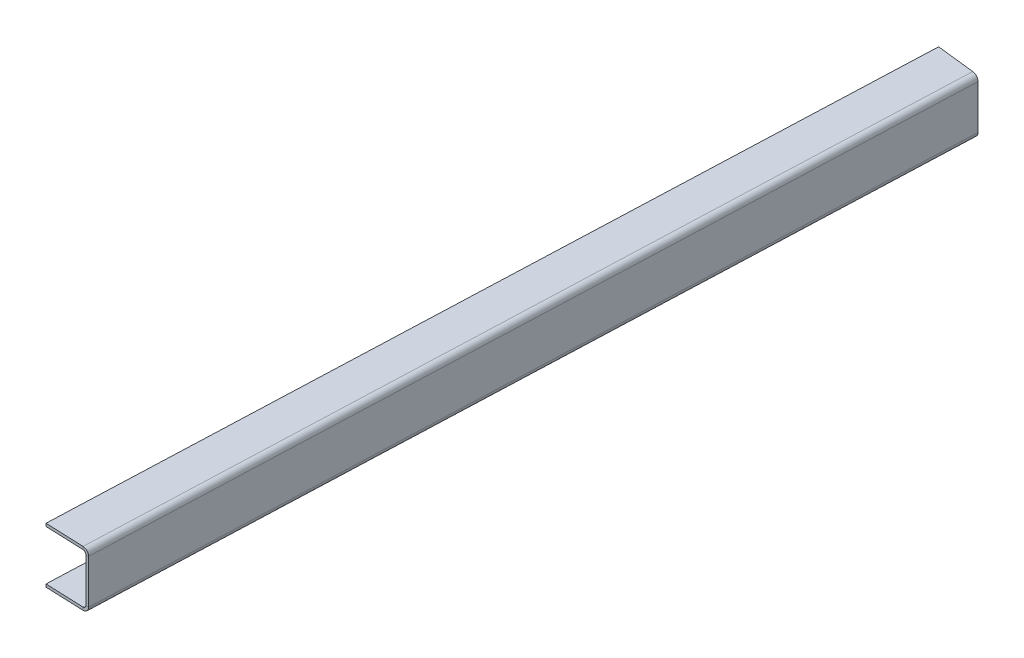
ISO-10303-21;
HEADER;
FILE_DESCRIPTION(('STEP AP214'),'2;1');
FILE_NAME('part.step','',(''),(''),'','','');
FILE_SCHEMA(('AUTOMOTIVE_DESIGN { 1 0 10303 214 1 1 1 1 }'));
ENDSEC;
DATA;
#1=APPLICATION_CONTEXT('core data for automotive mechanical design processes');
#2=APPLICATION_PROTOCOL_DEFINITION('international standard','automotive_design',2000,#1);
#3=PRODUCT_CONTEXT('',#1,'mechanical');
#4=PRODUCT('Part','Part','',(#3));
#5=PRODUCT_RELATED_PRODUCT_CATEGORY('part','',(#4));
#6=PRODUCT_DEFINITION_FORMATION('','',#4);
#7=PRODUCT_DEFINITION_CONTEXT('part definition',#1,'design');
#8=PRODUCT_DEFINITION('design','',#6,#7);
#9=PRODUCT_DEFINITION_SHAPE('','',#8);
#10=(LENGTH_UNIT() NAMED_UNIT(*) SI_UNIT(.MILLI.,.METRE.));
#11=(NAMED_UNIT(*) PLANE_ANGLE_UNIT() SI_UNIT($,.RADIAN.));
#12=(NAMED_UNIT(*) SI_UNIT($,.STERADIAN.) SOLID_ANGLE_UNIT());
#13=UNCERTAINTY_MEASURE_WITH_UNIT(LENGTH_MEASURE(1.E-05),#10,'distance_accuracy_value','');
#14=(GEOMETRIC_REPRESENTATION_CONTEXT(3) GLOBAL_UNCERTAINTY_ASSIGNED_CONTEXT((#13)) GLOBAL_UNIT_ASSIGNED_CONTEXT((#10,
#11,#12)) REPRESENTATION_CONTEXT('',''));
#15=CARTESIAN_POINT('',(0.,0.,0.));
#16=DIRECTION('',(0.,0.,1.));
#17=DIRECTION('',(1.,0.,0.));
#18=AXIS2_PLACEMENT_3D('',#15,#16,#17);
#19=CARTESIAN_POINT('',(-611.843515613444,0.,36.8292453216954));
#20=DIRECTION('',(0.0392134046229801,0.,-0.999230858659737));
#21=DIRECTION('',(0.,1.,0.));
#22=AXIS2_PLACEMENT_3D('',#19,#20,#21);
#23=PLANE('',#22);
#24=DIRECTION('',(-0.999230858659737,0.,-0.0392134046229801));
#25=VECTOR('',#24,1.);
#26=CARTESIAN_POINT('',(-611.843515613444,749.683430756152,36.8292453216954));
#27=LINE('',#26,#25);
#28=CARTESIAN_POINT('',(-610.219165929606,749.683430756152,36.8929906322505));
#29=VERTEX_POINT('',#28);
#30=CARTESIAN_POINT('',(-611.843515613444,749.683430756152,36.8292453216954));
#31=VERTEX_POINT('',#30);
#32=EDGE_CURVE('E12',#29,#31,#27,.T.);
#33=ORIENTED_EDGE('',*,*,#32,.F.);
#34=DIRECTION('',(0.,1.,0.));
#35=VECTOR('',#34,1.);
#36=CARTESIAN_POINT('',(-610.219165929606,0.,36.8929906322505));
#37=LINE('',#36,#35);
#38=CARTESIAN_POINT('',(-610.219165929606,774.931030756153,36.8929906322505));
#39=VERTEX_POINT('',#38);
#40=EDGE_CURVE('E137',#29,#39,#37,.T.);
#41=ORIENTED_EDGE('',*,*,#40,.T.);
#42=DIRECTION('',(-0.999230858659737,0.,-0.0392134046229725));
#43=VECTOR('',#42,1.);
#44=CARTESIAN_POINT('',(-611.843515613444,774.931030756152,36.8292453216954));
#45=LINE('',#44,#43);
#46=CARTESIAN_POINT('',(-611.843515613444,774.931030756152,36.8292453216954));
#47=VERTEX_POINT('',#46);
#48=EDGE_CURVE('E90',#39,#47,#45,.T.);
#49=ORIENTED_EDGE('',*,*,#48,.T.);
#50=DIRECTION('',(0.,1.,0.));
#51=VECTOR('',#50,1.);
#52=CARTESIAN_POINT('',(-611.843515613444,0.,36.8292453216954));
#53=LINE('',#52,#51);
#54=EDGE_CURVE('E139',#31,#47,#53,.T.);
#55=ORIENTED_EDGE('',*,*,#54,.F.);
#56=EDGE_LOOP('',(#33,#41,#49,#55));
#57=FACE_BOUND('',#56,.T.);
#58=ADVANCED_FACE('F78',(#57),#23,.F.);
#59=CARTESIAN_POINT('',(-615.092143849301,774.931030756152,36.6999421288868));
#60=CARTESIAN_POINT('',(-615.633593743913,774.931030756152,36.6786936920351));
#61=CARTESIAN_POINT('',(-616.175043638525,774.931030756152,36.6574452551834));
#62=CARTESIAN_POINT('',(-616.716493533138,774.931030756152,36.6361968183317));
#63=CARTESIAN_POINT('',(-615.092143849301,771.679830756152,36.6999421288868));
#64=CARTESIAN_POINT('',(-615.633593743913,770.596097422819,36.6786936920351));
#65=CARTESIAN_POINT('',(-616.175043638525,769.512364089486,36.6574452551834));
#66=CARTESIAN_POINT('',(-616.716493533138,768.428630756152,36.6361968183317));
#67=CARTESIAN_POINT('',(-611.843515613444,771.679830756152,36.8292453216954));
#68=CARTESIAN_POINT('',(-611.302065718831,770.596097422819,36.8504937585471));
#69=CARTESIAN_POINT('',(-610.760615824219,769.512364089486,36.8717421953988));
#70=CARTESIAN_POINT('',(-610.219165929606,768.428630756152,36.8929906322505));
#71=CARTESIAN_POINT('',(-611.843515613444,774.931030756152,36.8292453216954));
#72=CARTESIAN_POINT('',(-611.302065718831,774.931030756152,36.8504937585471));
#73=CARTESIAN_POINT('',(-610.760615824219,774.931030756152,36.8717421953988));
#74=CARTESIAN_POINT('',(-610.219165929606,774.931030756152,36.8929906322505));
#75=CARTESIAN_POINT('',(-611.843515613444,778.182230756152,36.8292453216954));
#76=CARTESIAN_POINT('',(-611.302065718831,779.265964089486,36.8504937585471));
#77=CARTESIAN_POINT('',(-610.760615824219,780.349697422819,36.8717421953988));
#78=CARTESIAN_POINT('',(-610.219165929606,781.433430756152,36.8929906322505));
#79=CARTESIAN_POINT('',(-615.092143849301,778.182230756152,36.6999421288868));
#80=CARTESIAN_POINT('',(-615.633593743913,779.265964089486,36.6786936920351));
#81=CARTESIAN_POINT('',(-616.175043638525,780.349697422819,36.6574452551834));
#82=CARTESIAN_POINT('',(-616.716493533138,781.433430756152,36.6361968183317));
#83=CARTESIAN_POINT('',(-615.092143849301,774.931030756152,36.6999421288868));
#84=CARTESIAN_POINT('',(-615.633593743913,774.931030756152,36.6786936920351));
#85=CARTESIAN_POINT('',(-616.175043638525,774.931030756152,36.6574452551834));
#86=CARTESIAN_POINT('',(-616.716493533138,774.931030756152,36.6361968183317));
#87=(BOUNDED_SURFACE() B_SPLINE_SURFACE(3,3,((#59,#60,#61,#62),(#63,#64,#65,#66),(#67,#68,#69,
#70),(#71,#72,#73,#74),(#75,#76,#77,#78),(#79,#80,#81,#82),(#83,#84,#85,#86)),.UNSPECIFIED.,.T.,
.F.,.F.) B_SPLINE_SURFACE_WITH_KNOTS((4,3,4),(4,4),(0.,0.5,1.),(0.,1.),
.UNSPECIFIED.) GEOMETRIC_REPRESENTATION_ITEM() RATIONAL_B_SPLINE_SURFACE(((1.,1.,1.,1.),
(0.333333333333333,0.333333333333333,0.333333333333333,0.333333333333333),(0.333333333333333,
0.333333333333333,0.333333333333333,0.333333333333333),(1.,1.,1.,1.),(0.333333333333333,
0.333333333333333,0.333333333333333,0.333333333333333),(0.333333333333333,0.333333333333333,
0.333333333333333,0.333333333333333),(1.,1.,1.,1.))) REPRESENTATION_ITEM('') SURFACE());
#88=CARTESIAN_POINT('',(-613.467829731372,774.931030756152,36.7645937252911));
#89=DIRECTION('',(-0.039492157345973,0.,0.999219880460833));
#90=DIRECTION('',(-0.999219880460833,0.,-0.039492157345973));
#91=AXIS2_PLACEMENT_3D('',#88,#89,#90);
#92=ELLIPSE('',#91,3.25120012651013,3.2512);
#93=CARTESIAN_POINT('',(-613.467829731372,778.182230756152,36.764593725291));
#94=VERTEX_POINT('',#93);
#95=EDGE_CURVE('E215',#39,#94,#92,.T.);
#96=DIRECTION('',(0.,-1.,0.));
#97=VECTOR('',#96,1.);
#98=CARTESIAN_POINT('',(-613.467829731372,776.556630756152,36.764593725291));
#99=LINE('',#98,#97);
#100=CARTESIAN_POINT('',(-613.467829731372,776.556630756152,36.764593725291));
#101=VERTEX_POINT('',#100);
#102=EDGE_CURVE('E205',#94,#101,#99,.T.);
#103=CARTESIAN_POINT('',(-613.467829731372,774.931030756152,36.7645937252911));
#104=DIRECTION('',(-0.0397709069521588,0.,0.999208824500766));
#105=DIRECTION('',(-0.999208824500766,0.,-0.0397709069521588));
#106=AXIS2_PLACEMENT_3D('',#103,#104,#105);
#107=ELLIPSE('',#106,1.62560025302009,1.6256);
#108=EDGE_CURVE('E213',#47,#101,#107,.T.);
#109=ORIENTED_EDGE('',*,*,#48,.F.);
#110=ORIENTED_EDGE('',*,*,#95,.T.);
#111=ORIENTED_EDGE('',*,*,#102,.T.);
#112=ORIENTED_EDGE('',*,*,#108,.F.);
#113=EDGE_LOOP('',(#109,#110,#111,#112));
#114=FACE_BOUND('',#113,.T.);
#115=ADVANCED_FACE('F212',(#114),#87,.F.);
#116=CARTESIAN_POINT('',(-635.603500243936,776.556630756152,35.8835409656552));
#117=DIRECTION('',(-0.0397709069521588,0.,0.999208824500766));
#118=DIRECTION('',(0.999208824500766,0.,0.0397709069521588));
#119=AXIS2_PLACEMENT_3D('',#116,#117,#118);
#120=PLANE('',#119);
#121=ORIENTED_EDGE('',*,*,#102,.F.);
#122=DIRECTION('',(0.999208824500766,0.,0.0397709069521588));
#123=VECTOR('',#122,1.);
#124=CARTESIAN_POINT('',(-635.603500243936,778.182230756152,35.8835409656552));
#125=LINE('',#124,#123);
#126=CARTESIAN_POINT('',(-635.603500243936,778.182230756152,35.8835409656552));
#127=VERTEX_POINT('',#126);
#128=EDGE_CURVE('E176',#127,#94,#125,.T.);
#129=ORIENTED_EDGE('',*,*,#128,.F.);
#130=DIRECTION('',(0.,-1.,0.));
#131=VECTOR('',#130,1.);
#132=CARTESIAN_POINT('',(-635.603500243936,776.556630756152,35.8835409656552));
#133=LINE('',#132,#131);
#134=CARTESIAN_POINT('',(-635.603500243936,776.556630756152,35.8835409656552));
#135=VERTEX_POINT('',#134);
#136=EDGE_CURVE('E202',#127,#135,#133,.T.);
#137=ORIENTED_EDGE('',*,*,#136,.T.);
#138=DIRECTION('',(0.999208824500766,0.,0.0397709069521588));
#139=VECTOR('',#138,1.);
#140=CARTESIAN_POINT('',(-635.603500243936,776.556630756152,35.8835409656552));
#141=LINE('',#140,#139);
#142=EDGE_CURVE('E232',#135,#101,#141,.T.);
#143=ORIENTED_EDGE('',*,*,#142,.T.);
#144=EDGE_LOOP('',(#121,#129,#137,#143));
#145=FACE_BOUND('',#144,.T.);
#146=ADVANCED_FACE('F233',(#145),#120,.T.);
#147=CARTESIAN_POINT('',(-616.284879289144,776.556630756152,-456.391036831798));
#148=DIRECTION('',(-0.999230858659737,0.,-0.0392134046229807));
#149=DIRECTION('',(-0.0392134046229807,0.,0.999230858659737));
#150=AXIS2_PLACEMENT_3D('',#147,#148,#149);
#151=PLANE('',#150);
#152=ORIENTED_EDGE('',*,*,#136,.F.);
#153=DIRECTION('',(-0.0392134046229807,0.,0.999230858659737));
#154=VECTOR('',#153,1.);
#155=CARTESIAN_POINT('',(-616.284879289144,778.182230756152,-456.391036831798));
#156=LINE('',#155,#154);
#157=CARTESIAN_POINT('',(-616.284879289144,778.182230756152,-456.391036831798));
#158=VERTEX_POINT('',#157);
#159=EDGE_CURVE('E168',#158,#127,#156,.T.);
#160=ORIENTED_EDGE('',*,*,#159,.F.);
#161=DIRECTION('',(0.,-1.,0.));
#162=VECTOR('',#161,1.);
#163=CARTESIAN_POINT('',(-616.284879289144,776.556630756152,-456.391036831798));
#164=LINE('',#163,#162);
#165=CARTESIAN_POINT('',(-616.284879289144,776.556630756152,-456.391036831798));
#166=VERTEX_POINT('',#165);
#167=EDGE_CURVE('E199',#158,#166,#164,.T.);
#168=ORIENTED_EDGE('',*,*,#167,.T.);
#169=DIRECTION('',(-0.0392134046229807,0.,0.999230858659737));
#170=VECTOR('',#169,1.);
#171=CARTESIAN_POINT('',(-616.284879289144,776.556630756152,-456.391036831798));
#172=LINE('',#171,#170);
#173=EDGE_CURVE('E237',#166,#135,#172,.T.);
#174=ORIENTED_EDGE('',*,*,#173,.T.);
#175=EDGE_LOOP('',(#152,#160,#168,#174));
#176=FACE_BOUND('',#175,.T.);
#177=ADVANCED_FACE('F280',(#176),#151,.T.);
#178=CARTESIAN_POINT('',(-590.977798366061,776.556630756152,-453.525083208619));
#179=DIRECTION('',(0.112527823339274,0.,-0.993648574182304));
#180=DIRECTION('',(-0.993648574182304,0.,-0.112527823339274));
#181=AXIS2_PLACEMENT_3D('',#178,#179,#180);
#182=PLANE('',#181);
#183=ORIENTED_EDGE('',*,*,#167,.F.);
#184=DIRECTION('',(-0.993648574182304,0.,-0.112527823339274));
#185=VECTOR('',#184,1.);
#186=CARTESIAN_POINT('',(-590.977798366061,778.182230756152,-453.525083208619));
#187=LINE('',#186,#185);
#188=CARTESIAN_POINT('',(-594.21272666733,778.182230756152,-453.891429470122));
#189=VERTEX_POINT('',#188);
#190=EDGE_CURVE('E173',#189,#158,#187,.T.);
#191=ORIENTED_EDGE('',*,*,#190,.F.);
#192=DIRECTION('',(0.,-1.,0.));
#193=VECTOR('',#192,1.);
#194=CARTESIAN_POINT('',(-594.21272666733,776.556630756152,-453.891429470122));
#195=LINE('',#194,#193);
#196=CARTESIAN_POINT('',(-594.21272666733,776.556630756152,-453.891429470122));
#197=VERTEX_POINT('',#196);
#198=EDGE_CURVE('E196',#189,#197,#195,.T.);
#199=ORIENTED_EDGE('',*,*,#198,.T.);
#200=DIRECTION('',(-0.993648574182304,0.,-0.112527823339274));
#201=VECTOR('',#200,1.);
#202=CARTESIAN_POINT('',(-590.977798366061,776.556630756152,-453.525083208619));
#203=LINE('',#202,#201);
#204=EDGE_CURVE('E238',#197,#166,#203,.T.);
#205=ORIENTED_EDGE('',*,*,#204,.T.);
#206=EDGE_LOOP('',(#183,#191,#199,#205));
#207=FACE_BOUND('',#206,.T.);
#208=ADVANCED_FACE('F307',(#207),#182,.T.);
#209=CARTESIAN_POINT('',(-595.832379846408,774.931030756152,-454.074850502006));
#210=CARTESIAN_POINT('',(-596.37382974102,774.931030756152,-454.096098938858));
#211=CARTESIAN_POINT('',(-596.915279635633,774.931030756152,-454.11734737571));
#212=CARTESIAN_POINT('',(-597.456729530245,774.931030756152,-454.138595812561));
#213=CARTESIAN_POINT('',(-595.832379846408,778.182230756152,-454.074850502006));
#214=CARTESIAN_POINT('',(-596.37382974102,779.265964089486,-454.096098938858));
#215=CARTESIAN_POINT('',(-596.915279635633,780.349697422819,-454.11734737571));
#216=CARTESIAN_POINT('',(-597.456729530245,781.433430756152,-454.138595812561));
#217=CARTESIAN_POINT('',(-592.593073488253,778.182230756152,-453.708008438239));
#218=CARTESIAN_POINT('',(-592.051623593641,779.265964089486,-453.686760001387));
#219=CARTESIAN_POINT('',(-591.510173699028,780.349697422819,-453.665511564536));
#220=CARTESIAN_POINT('',(-590.968723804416,781.433430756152,-453.644263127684));
#221=CARTESIAN_POINT('',(-592.593073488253,774.931030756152,-453.708008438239));
#222=CARTESIAN_POINT('',(-592.051623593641,774.931030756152,-453.686760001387));
#223=CARTESIAN_POINT('',(-591.510173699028,774.931030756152,-453.665511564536));
#224=CARTESIAN_POINT('',(-590.968723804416,774.931030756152,-453.644263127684));
#225=CARTESIAN_POINT('',(-592.593073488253,771.679830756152,-453.708008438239));
#226=CARTESIAN_POINT('',(-592.051623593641,770.59609742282,-453.686760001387));
#227=CARTESIAN_POINT('',(-591.510173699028,769.512364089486,-453.665511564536));
#228=CARTESIAN_POINT('',(-590.968723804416,768.428630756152,-453.644263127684));
#229=CARTESIAN_POINT('',(-595.832379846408,771.679830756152,-454.074850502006));
#230=CARTESIAN_POINT('',(-596.37382974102,770.59609742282,-454.096098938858));
#231=CARTESIAN_POINT('',(-596.915279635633,769.512364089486,-454.11734737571));
#232=CARTESIAN_POINT('',(-597.456729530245,768.428630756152,-454.138595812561));
#233=CARTESIAN_POINT('',(-595.832379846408,774.931030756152,-454.074850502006));
#234=CARTESIAN_POINT('',(-596.37382974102,774.931030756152,-454.096098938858));
#235=CARTESIAN_POINT('',(-596.915279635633,774.931030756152,-454.11734737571));
#236=CARTESIAN_POINT('',(-597.456729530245,774.931030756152,-454.138595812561));
#237=(BOUNDED_SURFACE() B_SPLINE_SURFACE(3,3,((#209,#210,#211,#212),(#213,#214,#215,#216),(#217,
#218,#219,#220),(#221,#222,#223,#224),(#225,#226,#227,#228),(#229,#230,#231,#232),(#233,#234,
#235,#236)),.UNSPECIFIED.,.T.,.F.,.F.) B_SPLINE_SURFACE_WITH_KNOTS((4,3,4),(4,4),(0.,0.5,1.),
(0.,1.),.UNSPECIFIED.) GEOMETRIC_REPRESENTATION_ITEM() RATIONAL_B_SPLINE_SURFACE(((1.,1.,1.,1.),
(0.333333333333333,0.333333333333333,0.333333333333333,0.333333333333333),(0.333333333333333,
0.333333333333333,0.333333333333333,0.333333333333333),(1.,1.,1.,1.),(0.333333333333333,
0.333333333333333,0.333333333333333,0.333333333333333),(0.333333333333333,0.333333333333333,
0.333333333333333,0.333333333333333),(1.,1.,1.,1.))) REPRESENTATION_ITEM('') SURFACE());
#238=CARTESIAN_POINT('',(-594.21272666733,774.931030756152,-453.891429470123));
#239=DIRECTION('',(0.075971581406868,0.,-0.997109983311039));
#240=DIRECTION('',(-0.997109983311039,0.,-0.0759715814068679));
#241=AXIS2_PLACEMENT_3D('',#238,#239,#240);
#242=ELLIPSE('',#241,3.25340525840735,3.2512);
#243=CARTESIAN_POINT('',(-590.968723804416,774.931030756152,-453.644263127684));
#244=VERTEX_POINT('',#243);
#245=EDGE_CURVE('E178',#189,#244,#242,.T.);
#246=DIRECTION('',(-0.999230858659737,0.,-0.0392134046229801));
#247=VECTOR('',#246,1.);
#248=CARTESIAN_POINT('',(-592.593073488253,774.931030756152,-453.708008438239));
#249=LINE('',#248,#247);
#250=CARTESIAN_POINT('',(-592.593073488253,774.931030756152,-453.708008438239));
#251=VERTEX_POINT('',#250);
#252=EDGE_CURVE('E194',#244,#251,#249,.T.);
#253=CARTESIAN_POINT('',(-594.21272666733,774.931030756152,-453.891429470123));
#254=DIRECTION('',(0.112527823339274,0.,-0.993648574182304));
#255=DIRECTION('',(-0.993648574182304,0.,-0.112527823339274));
#256=AXIS2_PLACEMENT_3D('',#253,#254,#255);
#257=ELLIPSE('',#256,1.63000604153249,1.6256);
#258=EDGE_CURVE('E229',#197,#251,#257,.T.);
#259=ORIENTED_EDGE('',*,*,#198,.F.);
#260=ORIENTED_EDGE('',*,*,#245,.T.);
#261=ORIENTED_EDGE('',*,*,#252,.T.);
#262=ORIENTED_EDGE('',*,*,#258,.F.);
#263=EDGE_LOOP('',(#259,#260,#261,#262));
#264=FACE_BOUND('',#263,.T.);
#265=ADVANCED_FACE('F357',(#264),#237,.F.);
#266=CARTESIAN_POINT('',(-592.593073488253,0.,-453.708008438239));
#267=DIRECTION('',(-0.0392134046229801,0.,0.999230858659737));
#268=DIRECTION('',(0.,-1.,0.));
#269=AXIS2_PLACEMENT_3D('',#266,#267,#268);
#270=PLANE('',#269);
#271=ORIENTED_EDGE('',*,*,#252,.F.);
#272=DIRECTION('',(0.,1.,0.));
#273=VECTOR('',#272,1.);
#274=CARTESIAN_POINT('',(-590.968723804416,0.,-453.644263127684));
#275=LINE('',#274,#273);
#276=CARTESIAN_POINT('',(-590.968723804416,749.683430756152,-453.644263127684));
#277=VERTEX_POINT('',#276);
#278=EDGE_CURVE('E167',#244,#277,#275,.F.);
#279=ORIENTED_EDGE('',*,*,#278,.T.);
#280=DIRECTION('',(-0.999230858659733,1.45035538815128E-13,-0.039213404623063));
#281=VECTOR('',#280,1.);
#282=CARTESIAN_POINT('',(-592.593073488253,749.683430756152,-453.708008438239));
#283=LINE('',#282,#281);
#284=CARTESIAN_POINT('',(-592.593073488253,749.683430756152,-453.708008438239));
#285=VERTEX_POINT('',#284);
#286=EDGE_CURVE('E191',#277,#285,#283,.T.);
#287=ORIENTED_EDGE('',*,*,#286,.T.);
#288=DIRECTION('',(0.,-1.,0.));
#289=VECTOR('',#288,1.);
#290=CARTESIAN_POINT('',(-592.593073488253,0.,-453.708008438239));
#291=LINE('',#290,#289);
#292=EDGE_CURVE('E284',#251,#285,#291,.T.);
#293=ORIENTED_EDGE('',*,*,#292,.F.);
#294=EDGE_LOOP('',(#271,#279,#287,#293));
#295=FACE_BOUND('',#294,.T.);
#296=ADVANCED_FACE('F322',(#295),#270,.F.);
#297=CARTESIAN_POINT('',(-592.593073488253,749.683430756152,-453.708008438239));
#298=CARTESIAN_POINT('',(-592.051623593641,749.683430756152,-453.686760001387));
#299=CARTESIAN_POINT('',(-591.510173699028,749.683430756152,-453.665511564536));
#300=CARTESIAN_POINT('',(-590.968723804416,749.683430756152,-453.644263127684));
#301=CARTESIAN_POINT('',(-592.593073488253,746.432230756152,-453.708008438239));
#302=CARTESIAN_POINT('',(-592.051623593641,745.348497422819,-453.686760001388));
#303=CARTESIAN_POINT('',(-591.510173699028,744.264764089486,-453.665511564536));
#304=CARTESIAN_POINT('',(-590.968723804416,743.181030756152,-453.644263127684));
#305=CARTESIAN_POINT('',(-595.832379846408,746.432230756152,-454.074850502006));
#306=CARTESIAN_POINT('',(-596.37382974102,745.348497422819,-454.096098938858));
#307=CARTESIAN_POINT('',(-596.915279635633,744.264764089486,-454.11734737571));
#308=CARTESIAN_POINT('',(-597.456729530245,743.181030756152,-454.138595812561));
#309=CARTESIAN_POINT('',(-595.832379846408,749.683430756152,-454.074850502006));
#310=CARTESIAN_POINT('',(-596.37382974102,749.683430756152,-454.096098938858));
#311=CARTESIAN_POINT('',(-596.915279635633,749.683430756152,-454.11734737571));
#312=CARTESIAN_POINT('',(-597.456729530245,749.683430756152,-454.138595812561));
#313=CARTESIAN_POINT('',(-595.832379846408,752.934630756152,-454.074850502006));
#314=CARTESIAN_POINT('',(-596.37382974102,754.018364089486,-454.096098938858));
#315=CARTESIAN_POINT('',(-596.915279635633,755.102097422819,-454.11734737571));
#316=CARTESIAN_POINT('',(-597.456729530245,756.185830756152,-454.138595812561));
#317=CARTESIAN_POINT('',(-592.593073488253,752.934630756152,-453.708008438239));
#318=CARTESIAN_POINT('',(-592.051623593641,754.018364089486,-453.686760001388));
#319=CARTESIAN_POINT('',(-591.510173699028,755.102097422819,-453.665511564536));
#320=CARTESIAN_POINT('',(-590.968723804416,756.185830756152,-453.644263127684));
#321=CARTESIAN_POINT('',(-592.593073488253,749.683430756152,-453.708008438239));
#322=CARTESIAN_POINT('',(-592.051623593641,749.683430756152,-453.686760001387));
#323=CARTESIAN_POINT('',(-591.510173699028,749.683430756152,-453.665511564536));
#324=CARTESIAN_POINT('',(-590.968723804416,749.683430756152,-453.644263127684));
#325=(BOUNDED_SURFACE() B_SPLINE_SURFACE(3,3,((#297,#298,#299,#300),(#301,#302,#303,#304),(#305,
#306,#307,#308),(#309,#310,#311,#312),(#313,#314,#315,#316),(#317,#318,#319,#320),(#321,#322,
#323,#324)),.UNSPECIFIED.,.T.,.F.,.F.) B_SPLINE_SURFACE_WITH_KNOTS((4,3,4),(4,4),(0.,0.5,1.),
(0.,1.),.UNSPECIFIED.) GEOMETRIC_REPRESENTATION_ITEM() RATIONAL_B_SPLINE_SURFACE(((1.,1.,1.,1.),
(0.333333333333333,0.333333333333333,0.333333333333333,0.333333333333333),(0.333333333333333,
0.333333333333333,0.333333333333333,0.333333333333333),(1.,1.,1.,1.),(0.333333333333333,
0.333333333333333,0.333333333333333,0.333333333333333),(0.333333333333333,0.333333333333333,
0.333333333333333,0.333333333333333),(1.,1.,1.,1.))) REPRESENTATION_ITEM('') SURFACE());
#326=CARTESIAN_POINT('',(-594.21272666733,749.683430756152,-453.891429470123));
#327=DIRECTION('',(0.075971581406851,0.,-0.99710998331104));
#328=DIRECTION('',(0.99710998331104,0.,0.075971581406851));
#329=AXIS2_PLACEMENT_3D('',#326,#327,#328);
#330=ELLIPSE('',#329,3.25340525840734,3.2512);
#331=CARTESIAN_POINT('',(-594.21272666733,746.432230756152,-453.891429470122));
#332=VERTEX_POINT('',#331);
#333=EDGE_CURVE('E155',#277,#332,#330,.T.);
#334=DIRECTION('',(0.,1.,0.));
#335=VECTOR('',#334,1.);
#336=CARTESIAN_POINT('',(-594.21272666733,748.057830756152,-453.891429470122));
#337=LINE('',#336,#335);
#338=CARTESIAN_POINT('',(-594.21272666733,748.057830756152,-453.891429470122));
#339=VERTEX_POINT('',#338);
#340=EDGE_CURVE('E188',#332,#339,#337,.T.);
#341=CARTESIAN_POINT('',(-594.21272666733,749.683430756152,-453.891429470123));
#342=DIRECTION('',(0.112527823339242,0.,-0.993648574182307));
#343=DIRECTION('',(0.993648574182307,0.,0.112527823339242));
#344=AXIS2_PLACEMENT_3D('',#341,#342,#343);
#345=ELLIPSE('',#344,1.63000604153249,1.6256);
#346=EDGE_CURVE('E254',#285,#339,#345,.T.);
#347=ORIENTED_EDGE('',*,*,#286,.F.);
#348=ORIENTED_EDGE('',*,*,#333,.T.);
#349=ORIENTED_EDGE('',*,*,#340,.T.);
#350=ORIENTED_EDGE('',*,*,#346,.F.);
#351=EDGE_LOOP('',(#347,#348,#349,#350));
#352=FACE_BOUND('',#351,.T.);
#353=ADVANCED_FACE('F326',(#352),#325,.F.);
#354=CARTESIAN_POINT('',(-616.284879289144,748.057830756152,-456.391036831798));
#355=DIRECTION('',(0.112527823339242,0.,-0.993648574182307));
#356=DIRECTION('',(0.993648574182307,0.,0.112527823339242));
#357=AXIS2_PLACEMENT_3D('',#354,#355,#356);
#358=PLANE('',#357);
#359=ORIENTED_EDGE('',*,*,#340,.F.);
#360=DIRECTION('',(0.993648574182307,0.,0.112527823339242));
#361=VECTOR('',#360,1.);
#362=CARTESIAN_POINT('',(-616.284879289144,746.432230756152,-456.391036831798));
#363=LINE('',#362,#361);
#364=CARTESIAN_POINT('',(-616.284879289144,746.432230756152,-456.391036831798));
#365=VERTEX_POINT('',#364);
#366=EDGE_CURVE('E262',#365,#332,#363,.T.);
#367=ORIENTED_EDGE('',*,*,#366,.F.);
#368=DIRECTION('',(0.,1.,0.));
#369=VECTOR('',#368,1.);
#370=CARTESIAN_POINT('',(-616.284879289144,748.057830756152,-456.391036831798));
#371=LINE('',#370,#369);
#372=CARTESIAN_POINT('',(-616.284879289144,748.057830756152,-456.391036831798));
#373=VERTEX_POINT('',#372);
#374=EDGE_CURVE('E185',#365,#373,#371,.T.);
#375=ORIENTED_EDGE('',*,*,#374,.T.);
#376=DIRECTION('',(0.993648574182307,0.,0.112527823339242));
#377=VECTOR('',#376,1.);
#378=CARTESIAN_POINT('',(-616.284879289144,748.057830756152,-456.391036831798));
#379=LINE('',#378,#377);
#380=EDGE_CURVE('E293',#373,#339,#379,.T.);
#381=ORIENTED_EDGE('',*,*,#380,.T.);
#382=EDGE_LOOP('',(#359,#367,#375,#381));
#383=FACE_BOUND('',#382,.T.);
#384=ADVANCED_FACE('F374',(#383),#358,.T.);
#385=CARTESIAN_POINT('',(-635.603500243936,748.057830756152,35.8835409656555));
#386=DIRECTION('',(-0.999230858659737,0.,-0.0392134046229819));
#387=DIRECTION('',(0.0392134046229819,0.,-0.999230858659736));
#388=AXIS2_PLACEMENT_3D('',#385,#386,#387);
#389=PLANE('',#388);
#390=ORIENTED_EDGE('',*,*,#374,.F.);
#391=DIRECTION('',(0.0392134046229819,0.,-0.999230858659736));
#392=VECTOR('',#391,1.);
#393=CARTESIAN_POINT('',(-635.603500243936,746.432230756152,35.8835409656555));
#394=LINE('',#393,#392);
#395=CARTESIAN_POINT('',(-635.603500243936,746.432230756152,35.8835409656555));
#396=VERTEX_POINT('',#395);
#397=EDGE_CURVE('E255',#396,#365,#394,.T.);
#398=ORIENTED_EDGE('',*,*,#397,.F.);
#399=DIRECTION('',(0.,1.,0.));
#400=VECTOR('',#399,1.);
#401=CARTESIAN_POINT('',(-635.603500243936,748.057830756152,35.8835409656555));
#402=LINE('',#401,#400);
#403=CARTESIAN_POINT('',(-635.603500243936,748.057830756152,35.8835409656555));
#404=VERTEX_POINT('',#403);
#405=EDGE_CURVE('E182',#396,#404,#402,.T.);
#406=ORIENTED_EDGE('',*,*,#405,.T.);
#407=DIRECTION('',(0.0392134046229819,0.,-0.999230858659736));
#408=VECTOR('',#407,1.);
#409=CARTESIAN_POINT('',(-635.603500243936,748.057830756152,35.8835409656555));
#410=LINE('',#409,#408);
#411=EDGE_CURVE('E296',#404,#373,#410,.T.);
#412=ORIENTED_EDGE('',*,*,#411,.T.);
#413=EDGE_LOOP('',(#390,#398,#406,#412));
#414=FACE_BOUND('',#413,.T.);
#415=ADVANCED_FACE('F382',(#414),#389,.T.);
#416=CARTESIAN_POINT('',(-610.223592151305,748.057830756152,36.893722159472));
#417=DIRECTION('',(-0.0397709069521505,0.,0.999208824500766));
#418=DIRECTION('',(-0.999208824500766,0.,-0.0397709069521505));
#419=AXIS2_PLACEMENT_3D('',#416,#417,#418);
#420=PLANE('',#419);
#421=ORIENTED_EDGE('',*,*,#405,.F.);
#422=DIRECTION('',(-0.999208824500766,0.,-0.0397709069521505));
#423=VECTOR('',#422,1.);
#424=CARTESIAN_POINT('',(-610.223592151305,746.432230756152,36.893722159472));
#425=LINE('',#424,#423);
#426=CARTESIAN_POINT('',(-613.467829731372,746.432230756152,36.7645937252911));
#427=VERTEX_POINT('',#426);
#428=EDGE_CURVE('E259',#427,#396,#425,.T.);
#429=ORIENTED_EDGE('',*,*,#428,.F.);
#430=DIRECTION('',(0.,1.,0.));
#431=VECTOR('',#430,1.);
#432=CARTESIAN_POINT('',(-613.467829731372,748.057830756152,36.7645937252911));
#433=LINE('',#432,#431);
#434=CARTESIAN_POINT('',(-613.467829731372,748.057830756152,36.7645937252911));
#435=VERTEX_POINT('',#434);
#436=EDGE_CURVE('E84',#427,#435,#433,.T.);
#437=ORIENTED_EDGE('',*,*,#436,.T.);
#438=DIRECTION('',(-0.999208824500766,0.,-0.0397709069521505));
#439=VECTOR('',#438,1.);
#440=CARTESIAN_POINT('',(-610.223592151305,748.057830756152,36.893722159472));
#441=LINE('',#440,#439);
#442=EDGE_CURVE('E290',#435,#404,#441,.T.);
#443=ORIENTED_EDGE('',*,*,#442,.T.);
#444=EDGE_LOOP('',(#421,#429,#437,#443));
#445=FACE_BOUND('',#444,.T.);
#446=ADVANCED_FACE('F386',(#445),#420,.T.);
#447=CARTESIAN_POINT('',(-611.843515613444,749.683430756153,36.8292453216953));
#448=CARTESIAN_POINT('',(-611.302065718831,749.683430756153,36.850493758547));
#449=CARTESIAN_POINT('',(-610.760615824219,749.683430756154,36.8717421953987));
#450=CARTESIAN_POINT('',(-610.219165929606,749.683430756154,36.8929906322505));
#451=CARTESIAN_POINT('',(-611.843515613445,752.934630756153,36.8292453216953));
#452=CARTESIAN_POINT('',(-611.302065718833,754.018364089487,36.850493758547));
#453=CARTESIAN_POINT('',(-610.760615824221,755.10209742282,36.8717421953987));
#454=CARTESIAN_POINT('',(-610.219165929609,756.185830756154,36.8929906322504));
#455=CARTESIAN_POINT('',(-615.092143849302,752.934630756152,36.6999421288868));
#456=CARTESIAN_POINT('',(-615.633593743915,754.018364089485,36.6786936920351));
#457=CARTESIAN_POINT('',(-616.175043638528,755.102097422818,36.6574452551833));
#458=CARTESIAN_POINT('',(-616.71649353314,756.185830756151,36.6361968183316));
#459=CARTESIAN_POINT('',(-615.092143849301,749.683430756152,36.6999421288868));
#460=CARTESIAN_POINT('',(-615.633593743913,749.683430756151,36.6786936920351));
#461=CARTESIAN_POINT('',(-616.175043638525,749.683430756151,36.6574452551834));
#462=CARTESIAN_POINT('',(-616.716493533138,749.683430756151,36.6361968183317));
#463=CARTESIAN_POINT('',(-615.092143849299,746.432230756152,36.6999421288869));
#464=CARTESIAN_POINT('',(-615.633593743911,745.348497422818,36.6786936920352));
#465=CARTESIAN_POINT('',(-616.175043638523,744.264764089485,36.6574452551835));
#466=CARTESIAN_POINT('',(-616.716493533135,743.181030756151,36.6361968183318));
#467=CARTESIAN_POINT('',(-611.843515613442,746.432230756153,36.8292453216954));
#468=CARTESIAN_POINT('',(-611.30206571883,745.34849742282,36.8504937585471));
#469=CARTESIAN_POINT('',(-610.760615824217,744.264764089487,36.8717421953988));
#470=CARTESIAN_POINT('',(-610.219165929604,743.181030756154,36.8929906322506));
#471=CARTESIAN_POINT('',(-611.843515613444,749.683430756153,36.8292453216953));
#472=CARTESIAN_POINT('',(-611.302065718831,749.683430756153,36.850493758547));
#473=CARTESIAN_POINT('',(-610.760615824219,749.683430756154,36.8717421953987));
#474=CARTESIAN_POINT('',(-610.219165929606,749.683430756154,36.8929906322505));
#475=(BOUNDED_SURFACE() B_SPLINE_SURFACE(3,3,((#447,#448,#449,#450),(#451,#452,#453,#454),(#455,
#456,#457,#458),(#459,#460,#461,#462),(#463,#464,#465,#466),(#467,#468,#469,#470),(#471,#472,
#473,#474)),.UNSPECIFIED.,.T.,.F.,.F.) B_SPLINE_SURFACE_WITH_KNOTS((4,3,4),(4,4),(0.,0.5,1.),
(0.,1.),.UNSPECIFIED.) GEOMETRIC_REPRESENTATION_ITEM() RATIONAL_B_SPLINE_SURFACE(((1.,1.,1.,1.),
(0.333333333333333,0.333333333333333,0.333333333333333,0.333333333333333),(0.333333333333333,
0.333333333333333,0.333333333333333,0.333333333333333),(1.,1.,1.,1.),(0.333333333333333,
0.333333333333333,0.333333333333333,0.333333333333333),(0.333333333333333,0.333333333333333,
0.333333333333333,0.333333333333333),(1.,1.,1.,1.))) REPRESENTATION_ITEM('') SURFACE());
#476=CARTESIAN_POINT('',(-613.467829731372,749.683430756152,36.7645937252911));
#477=DIRECTION('',(-0.0394921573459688,0.,0.999219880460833));
#478=DIRECTION('',(0.999219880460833,4.09777183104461E-13,0.0394921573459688));
#479=AXIS2_PLACEMENT_3D('',#476,#477,#478);
#480=ELLIPSE('',#479,3.25120012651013,3.2512);
#481=EDGE_CURVE('E152',#427,#29,#480,.T.);
#482=CARTESIAN_POINT('',(-613.467829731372,749.683430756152,36.7645937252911));
#483=DIRECTION('',(-0.0397709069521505,0.,0.999208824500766));
#484=DIRECTION('',(0.999208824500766,4.0543697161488E-13,0.0397709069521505));
#485=AXIS2_PLACEMENT_3D('',#482,#483,#484);
#486=ELLIPSE('',#485,1.62560025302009,1.6256);
#487=EDGE_CURVE('E250',#435,#31,#486,.T.);
#488=ORIENTED_EDGE('',*,*,#481,.T.);
#489=ORIENTED_EDGE('',*,*,#32,.T.);
#490=ORIENTED_EDGE('',*,*,#487,.F.);
#491=ORIENTED_EDGE('',*,*,#436,.F.);
#492=EDGE_LOOP('',(#488,#489,#490,#491));
#493=FACE_BOUND('',#492,.T.);
#494=ADVANCED_FACE('F80',(#493),#475,.F.);
#495=CARTESIAN_POINT('',(0.,748.057830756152,-1.72850165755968E-13));
#496=DIRECTION('',(0.,-1.,0.));
#497=DIRECTION('',(0.,0.,-1.));
#498=AXIS2_PLACEMENT_3D('',#495,#496,#497);
#499=PLANE('',#498);
#500=ORIENTED_EDGE('',*,*,#442,.F.);
#501=DIRECTION('',(0.0392134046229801,0.,-0.999230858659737));
#502=VECTOR('',#501,1.);
#503=CARTESIAN_POINT('',(-594.21742317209,748.057830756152,-453.771753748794));
#504=LINE('',#503,#502);
#505=EDGE_CURVE('E247',#435,#339,#504,.T.);
#506=ORIENTED_EDGE('',*,*,#505,.T.);
#507=ORIENTED_EDGE('',*,*,#380,.F.);
#508=ORIENTED_EDGE('',*,*,#411,.F.);
#509=EDGE_LOOP('',(#500,#506,#507,#508));
#510=FACE_BOUND('',#509,.T.);
#511=ADVANCED_FACE('F411',(#510),#499,.F.);
#512=CARTESIAN_POINT('',(-609.457258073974,0.,-23.977057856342));
#513=DIRECTION('',(0.999230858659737,0.,0.0392134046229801));
#514=DIRECTION('',(0.0392134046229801,0.,-0.999230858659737));
#515=AXIS2_PLACEMENT_3D('',#512,#513,#514);
#516=PLANE('',#515);
#517=ORIENTED_EDGE('',*,*,#54,.T.);
#518=DIRECTION('',(-0.0392134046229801,0.,0.999230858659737));
#519=VECTOR('',#518,1.);
#520=CARTESIAN_POINT('',(-592.593073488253,774.931030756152,-453.708008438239));
#521=LINE('',#520,#519);
#522=EDGE_CURVE('E228',#47,#251,#521,.F.);
#523=ORIENTED_EDGE('',*,*,#522,.T.);
#524=ORIENTED_EDGE('',*,*,#292,.T.);
#525=DIRECTION('',(0.0392134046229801,0.,-0.999230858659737));
#526=VECTOR('',#525,1.);
#527=CARTESIAN_POINT('',(-611.843515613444,749.683430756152,36.8292453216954));
#528=LINE('',#527,#526);
#529=EDGE_CURVE('E244',#285,#31,#528,.F.);
#530=ORIENTED_EDGE('',*,*,#529,.T.);
#531=EDGE_LOOP('',(#517,#523,#524,#530));
#532=FACE_BOUND('',#531,.T.);
#533=ADVANCED_FACE('F325',(#532),#516,.F.);
#534=CARTESIAN_POINT('',(0.,776.556630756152,0.));
#535=DIRECTION('',(0.,1.,0.));
#536=DIRECTION('',(0.,0.,1.));
#537=AXIS2_PLACEMENT_3D('',#534,#535,#536);
#538=PLANE('',#537);
#539=ORIENTED_EDGE('',*,*,#204,.F.);
#540=DIRECTION('',(-0.0392134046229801,0.,0.999230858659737));
#541=VECTOR('',#540,1.);
#542=CARTESIAN_POINT('',(-613.467865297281,776.556630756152,36.7655000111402));
#543=LINE('',#542,#541);
#544=EDGE_CURVE('E226',#197,#101,#543,.T.);
#545=ORIENTED_EDGE('',*,*,#544,.T.);
#546=ORIENTED_EDGE('',*,*,#142,.F.);
#547=ORIENTED_EDGE('',*,*,#173,.F.);
#548=EDGE_LOOP('',(#539,#545,#546,#547));
#549=FACE_BOUND('',#548,.T.);
#550=ADVANCED_FACE('F241',(#549),#538,.F.);
#551=CARTESIAN_POINT('',(-611.08394966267,749.683430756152,-23.9811270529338));
#552=DIRECTION('',(-0.0392134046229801,0.,0.999230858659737));
#553=DIRECTION('',(0.999230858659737,0.,0.0392134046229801));
#554=AXIS2_PLACEMENT_3D('',#551,#552,#553);
#555=CYLINDRICAL_SURFACE('',#554,1.6256);
#556=ORIENTED_EDGE('',*,*,#487,.T.);
#557=ORIENTED_EDGE('',*,*,#529,.F.);
#558=ORIENTED_EDGE('',*,*,#346,.T.);
#559=ORIENTED_EDGE('',*,*,#505,.F.);
#560=EDGE_LOOP('',(#556,#557,#558,#559));
#561=FACE_BOUND('',#560,.T.);
#562=ADVANCED_FACE('F327',(#561),#555,.F.);
#563=CARTESIAN_POINT('',(-611.08394966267,774.931030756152,-23.9811270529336));
#564=DIRECTION('',(0.0392134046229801,0.,-0.999230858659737));
#565=DIRECTION('',(-0.999230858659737,0.,-0.0392134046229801));
#566=AXIS2_PLACEMENT_3D('',#563,#564,#565);
#567=CYLINDRICAL_SURFACE('',#566,1.6256);
#568=ORIENTED_EDGE('',*,*,#258,.T.);
#569=ORIENTED_EDGE('',*,*,#522,.F.);
#570=ORIENTED_EDGE('',*,*,#108,.T.);
#571=ORIENTED_EDGE('',*,*,#544,.F.);
#572=EDGE_LOOP('',(#568,#569,#570,#571));
#573=FACE_BOUND('',#572,.T.);
#574=ADVANCED_FACE('F224',(#573),#567,.F.);
#575=CARTESIAN_POINT('',(0.,746.432230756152,-1.72483786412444E-13));
#576=DIRECTION('',(0.,-1.,0.));
#577=DIRECTION('',(0.,0.,-1.));
#578=AXIS2_PLACEMENT_3D('',#575,#576,#577);
#579=PLANE('',#578);
#580=ORIENTED_EDGE('',*,*,#428,.T.);
#581=ORIENTED_EDGE('',*,*,#397,.T.);
#582=ORIENTED_EDGE('',*,*,#366,.T.);
#583=DIRECTION('',(-0.0392134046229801,0.,0.999230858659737));
#584=VECTOR('',#583,1.);
#585=CARTESIAN_POINT('',(-611.08394966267,746.432230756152,-23.9811270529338));
#586=LINE('',#585,#584);
#587=EDGE_CURVE('E160',#427,#332,#586,.F.);
#588=ORIENTED_EDGE('',*,*,#587,.F.);
#589=EDGE_LOOP('',(#580,#581,#582,#588));
#590=FACE_BOUND('',#589,.T.);
#591=ADVANCED_FACE('F334',(#590),#579,.T.);
#592=CARTESIAN_POINT('',(-607.832908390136,0.,-23.9133125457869));
#593=DIRECTION('',(0.999230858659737,0.,0.0392134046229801));
#594=DIRECTION('',(0.0392134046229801,0.,-0.999230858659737));
#595=AXIS2_PLACEMENT_3D('',#592,#593,#594);
#596=PLANE('',#595);
#597=ORIENTED_EDGE('',*,*,#40,.F.);
#598=DIRECTION('',(0.0392134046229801,0.,-0.999230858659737));
#599=VECTOR('',#598,1.);
#600=CARTESIAN_POINT('',(-607.832908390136,749.683430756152,-23.9133125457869));
#601=LINE('',#600,#599);
#602=EDGE_CURVE('E149',#277,#29,#601,.F.);
#603=ORIENTED_EDGE('',*,*,#602,.F.);
#604=ORIENTED_EDGE('',*,*,#278,.F.);
#605=DIRECTION('',(0.0392134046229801,0.,-0.999230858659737));
#606=VECTOR('',#605,1.);
#607=CARTESIAN_POINT('',(-607.832908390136,774.931030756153,-23.9133125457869));
#608=LINE('',#607,#606);
#609=EDGE_CURVE('E165',#39,#244,#608,.T.);
#610=ORIENTED_EDGE('',*,*,#609,.F.);
#611=EDGE_LOOP('',(#597,#603,#604,#610));
#612=FACE_BOUND('',#611,.T.);
#613=ADVANCED_FACE('F163',(#612),#596,.T.);
#614=CARTESIAN_POINT('',(0.,778.182230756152,0.));
#615=DIRECTION('',(0.,1.,0.));
#616=DIRECTION('',(0.,0.,1.));
#617=AXIS2_PLACEMENT_3D('',#614,#615,#616);
#618=PLANE('',#617);
#619=ORIENTED_EDGE('',*,*,#190,.T.);
#620=ORIENTED_EDGE('',*,*,#159,.T.);
#621=ORIENTED_EDGE('',*,*,#128,.T.);
#622=DIRECTION('',(0.0392134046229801,0.,-0.999230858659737));
#623=VECTOR('',#622,1.);
#624=CARTESIAN_POINT('',(-611.08394966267,778.182230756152,-23.9811270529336));
#625=LINE('',#624,#623);
#626=EDGE_CURVE('E159',#189,#94,#625,.F.);
#627=ORIENTED_EDGE('',*,*,#626,.F.);
#628=EDGE_LOOP('',(#619,#620,#621,#627));
#629=FACE_BOUND('',#628,.T.);
#630=ADVANCED_FACE('F275',(#629),#618,.T.);
#631=CARTESIAN_POINT('',(-611.08394966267,749.683430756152,-23.9811270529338));
#632=DIRECTION('',(-0.0392134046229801,0.,0.999230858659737));
#633=DIRECTION('',(0.999230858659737,0.,0.0392134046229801));
#634=AXIS2_PLACEMENT_3D('',#631,#632,#633);
#635=CYLINDRICAL_SURFACE('',#634,3.2512);
#636=ORIENTED_EDGE('',*,*,#481,.F.);
#637=ORIENTED_EDGE('',*,*,#587,.T.);
#638=ORIENTED_EDGE('',*,*,#333,.F.);
#639=ORIENTED_EDGE('',*,*,#602,.T.);
#640=EDGE_LOOP('',(#636,#637,#638,#639));
#641=FACE_BOUND('',#640,.T.);
#642=ADVANCED_FACE('F150',(#641),#635,.T.);
#643=CARTESIAN_POINT('',(-611.08394966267,774.931030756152,-23.9811270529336));
#644=DIRECTION('',(0.0392134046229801,0.,-0.999230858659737));
#645=DIRECTION('',(-0.999230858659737,0.,-0.0392134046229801));
#646=AXIS2_PLACEMENT_3D('',#643,#644,#645);
#647=CYLINDRICAL_SURFACE('',#646,3.2512);
#648=ORIENTED_EDGE('',*,*,#245,.F.);
#649=ORIENTED_EDGE('',*,*,#626,.T.);
#650=ORIENTED_EDGE('',*,*,#95,.F.);
#651=ORIENTED_EDGE('',*,*,#609,.T.);
#652=EDGE_LOOP('',(#648,#649,#650,#651));
#653=FACE_BOUND('',#652,.T.);
#654=ADVANCED_FACE('F391',(#653),#647,.T.);
#655=CLOSED_SHELL('',(#58,#115,#146,#177,#208,#265,#296,#353,#384,#415,#446,#494,#511,#533,#550,
#562,#574,#591,#613,#630,#642,#654));
#656=MANIFOLD_SOLID_BREP('B2',#655);
#657=ADVANCED_BREP_SHAPE_REPRESENTATION('',(#18,#656),#14);
#658=SHAPE_DEFINITION_REPRESENTATION(#9,#657);
ENDSEC;
END-ISO-10303-21;
